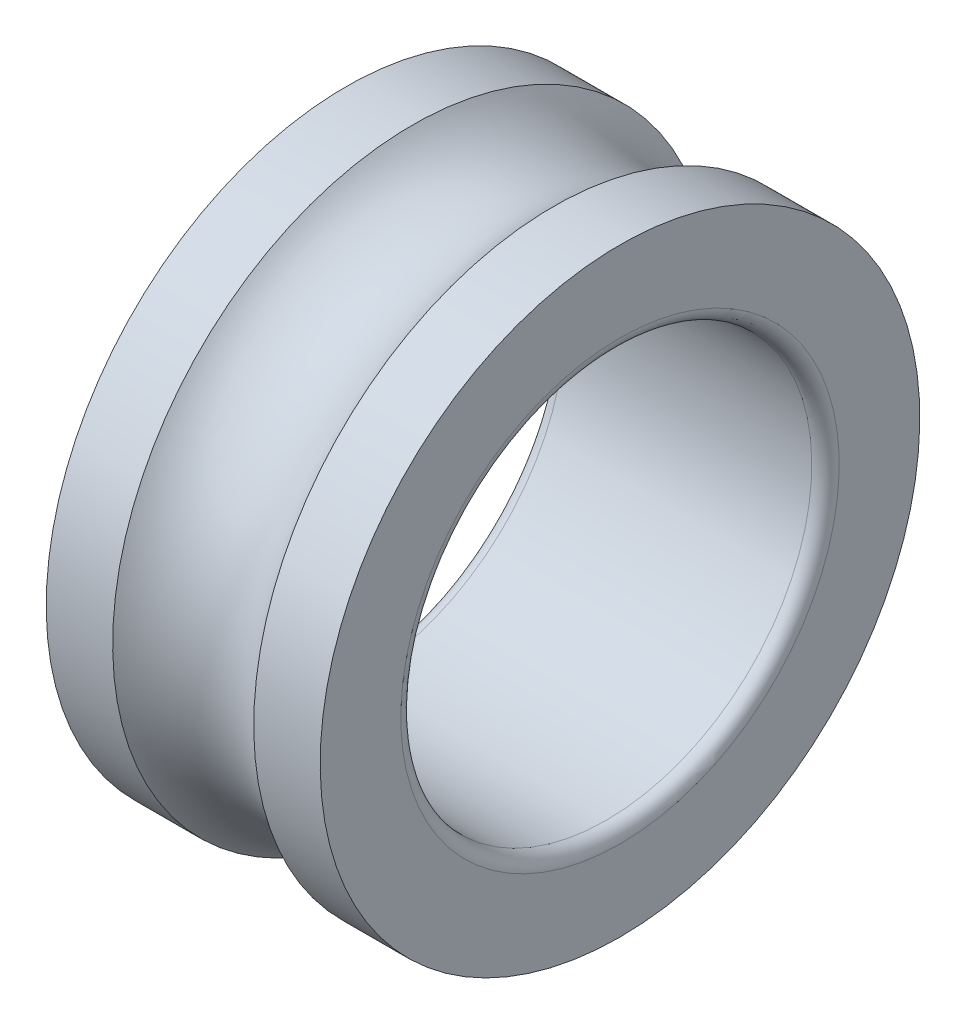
from build123d import *


with BuildPart() as part:
    # Esquisse1 → R_volution1 (revolve)
    with BuildSketch(Plane.XY, mode=Mode.PRIVATE) as r_volution1_sk:
        with BuildLine():
            Line((0, 8.754), (0, 6.4))
            ThreePointArc((0, 6.4), (0.117157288, 6.117157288), (0.4, 6))
            Line((0.4, 6), (7.6, 6))
            ThreePointArc((7.6, 6), (7.882842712, 6.117157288), (8, 6.4))
            Line((8, 6.4), (8, 8.754))
            Line((8, 8.754), (6.059486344, 8.754))
            ThreePointArc((6.059486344, 8.754), (4, 7.8), (1.940513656, 8.754))
            Line((1.940513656, 8.754), (0, 8.754))
        make_face()
    revolve(r_volution1_sk.sketch.rotate(Axis((8, 0, 0), (-1, 0, 0)), 180), axis=Axis((8, 0, 0), (-1, 0, 0)))


solid = part.part
